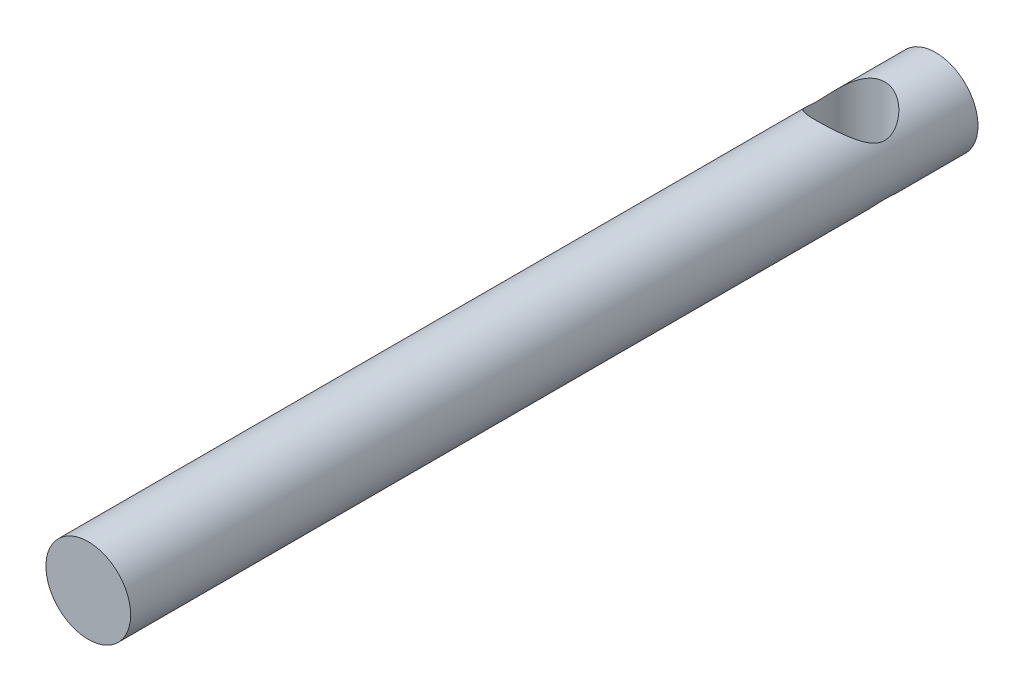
from build123d import *

# Parameters (mm, degrees)
ESQUISSE1_R                  = 5
EXTRUSION1_DEPTH             = 50
ENL_V_MAT_EXTRU_1_DEPTH      = 51.497524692
ENL_V_MAT_EXTRU_1_DEPTH_BACK = 51.497524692
ESQUISSE2_R                  = 4


with BuildPart() as part:
    # Esquisse1 → Extrusion1 (new, symmetric)
    with BuildSketch(Plane.XY):
        Circle(ESQUISSE1_R)
    extrude(amount=EXTRUSION1_DEPTH, both=True)

    # Esquisse2 → Enl_v. mat.-Extru.1 (cut, two sides: drawn at the far end of the back side and taken through both)
    with BuildSketch(Plane(origin=(0, 0, 0), x_dir=(1, 0, 0), z_dir=(0, 1, 0)).offset(-ENL_V_MAT_EXTRU_1_DEPTH_BACK)):
        with Locations(Location((0, 40, 0), (0, 0, 270))):
            Circle(ESQUISSE2_R)
    extrude(amount=ENL_V_MAT_EXTRU_1_DEPTH + ENL_V_MAT_EXTRU_1_DEPTH_BACK, mode=Mode.SUBTRACT)


solid = part.part
